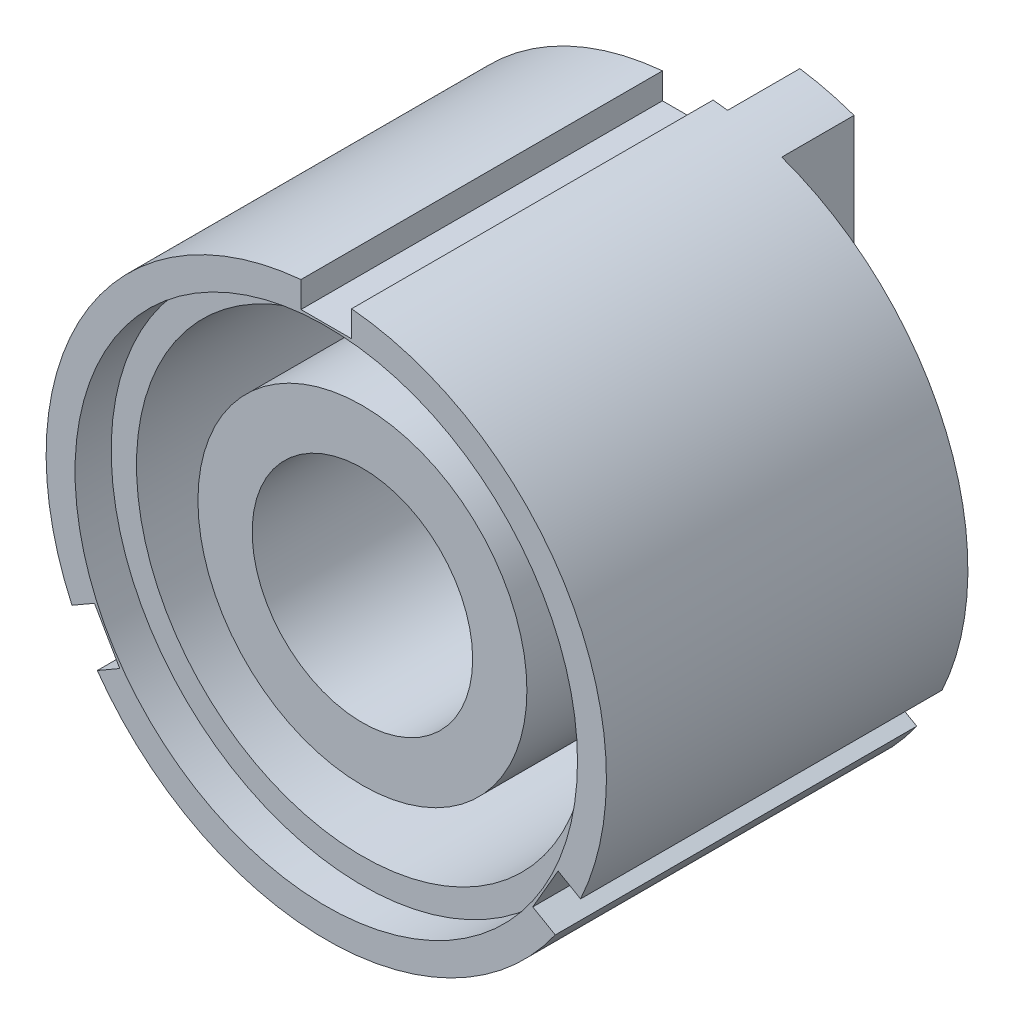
from build123d import *

# Parameters (mm, degrees)
ESQUISSE1_R                  = 7.75
ESQUISSE1_R_2                = 3.05
BASE_EXTRUSION_DEPTH         = 10
COQUE1_T                     = -1.5
ESQUISSE2_OUTSIDE_W          = 22.318
ESQUISSE2_OUTSIDE_H          = 22.318
ESQUISSE2_OUTSIDE_R          = 7.75
ESQUISSE2_OUTSIDE_R_2        = 6.95
ENL_V_MAT_EXTRU_1_DEPTH      = 1
ENL_V_MAT_EXTRU_2_DEPTH      = 15.836610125
R_P_TITION_CIRCULAIRE1_COUNT = 3
BOSS_EXTRU_1_START           = 2
BOSS_EXTRU_1_DEPTH           = 2
R_P_TITION_CIRCULAIRE2_COUNT = 2


with BuildPart() as part:
    # Esquisse1 → Base-Extrusion (new body)
    with BuildSketch(Plane.XY):
        Circle(ESQUISSE1_R)
        Circle(ESQUISSE1_R_2, mode=Mode.SUBTRACT)
    extrude(amount=BASE_EXTRUSION_DEPTH)

    # Coque1
    coque1_openings = [part.faces().sort_by_distance(p)[0] for p in [
        (-7.530796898, 0, 10),
    ]]
    offset(amount=COQUE1_T, openings=coque1_openings, kind=Kind.INTERSECTION)

    # Esquisse2 outside → Enl_v. mat.-Extru.1 (cut)
    # profile 1 of 2: a face of its own
    with BuildSketch(Plane.XY.offset(10)):
        Rectangle(ESQUISSE2_OUTSIDE_W, ESQUISSE2_OUTSIDE_H)
        Circle(ESQUISSE2_OUTSIDE_R, mode=Mode.SUBTRACT)
    # profile 2 of 2: a face of its own
    with BuildSketch(Plane.XY.offset(10)):
        Circle(ESQUISSE2_OUTSIDE_R_2)
    extrude(amount=-ENL_V_MAT_EXTRU_1_DEPTH, mode=Mode.SUBTRACT)

    # Esquisse3 → Enl_v. mat.-Extru.2 (cut, through all)
    with BuildSketch(Plane.XY.offset(10)):
        with BuildLine():
            Line((-0.7, 7.718322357), (-0.7, 7))
            Line((-0.7, 7), (0.7, 7))
            Line((0.7, 7), (0.7, 7.718322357))
            ThreePointArc((0.7, 7.718322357), (0, 7.75), (-0.7, 7.718322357))
        make_face()
    enl_v_mat_extru_2 = extrude(amount=-ENL_V_MAT_EXTRU_2_DEPTH, mode=Mode.SUBTRACT)

    # R_p_tition circulaire1: Enl_v. mat.-Extru.2 ×3 about axis
    r_p_tition_circulaire1_axis = Axis((0, 0, 0), (0, 0, 1))
    for i in range(1, R_P_TITION_CIRCULAIRE1_COUNT):
        add(enl_v_mat_extru_2.rotate(r_p_tition_circulaire1_axis, i * 360 / R_P_TITION_CIRCULAIRE1_COUNT), mode=Mode.SUBTRACT)

    # Esquisse4 → Boss.-Extru.1 (add)
    with BuildSketch(Plane(origin=(0, 0, 0), x_dir=(-1, 0, 0), z_dir=(0, 0, -1)).offset(BOSS_EXTRU_1_START)):
        with BuildLine():
            Line((-2.6, 7.300856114), (-2.6, 1.688194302))
            ThreePointArc((-2.6, 1.688194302), (-1.946425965, 2.412763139), (-1.1, 2.898275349))
            Line((-1.1, 2.898275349), (-1.1, 7.671538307))
            ThreePointArc((-1.1, 7.671538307), (-1.859260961, 7.523672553), (-2.6, 7.300856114))
        make_face()
    boss_extru_1 = extrude(amount=-BOSS_EXTRU_1_DEPTH)

    # R_p_tition circulaire2: Boss.-Extru.1 ×2 about axis
    r_p_tition_circulaire2_axis = Axis((0, 0, 0), (0, 0, -1))
    for i in range(1, R_P_TITION_CIRCULAIRE2_COUNT):
        add(boss_extru_1.rotate(r_p_tition_circulaire2_axis, i * 360 / R_P_TITION_CIRCULAIRE2_COUNT))


solid = part.part
